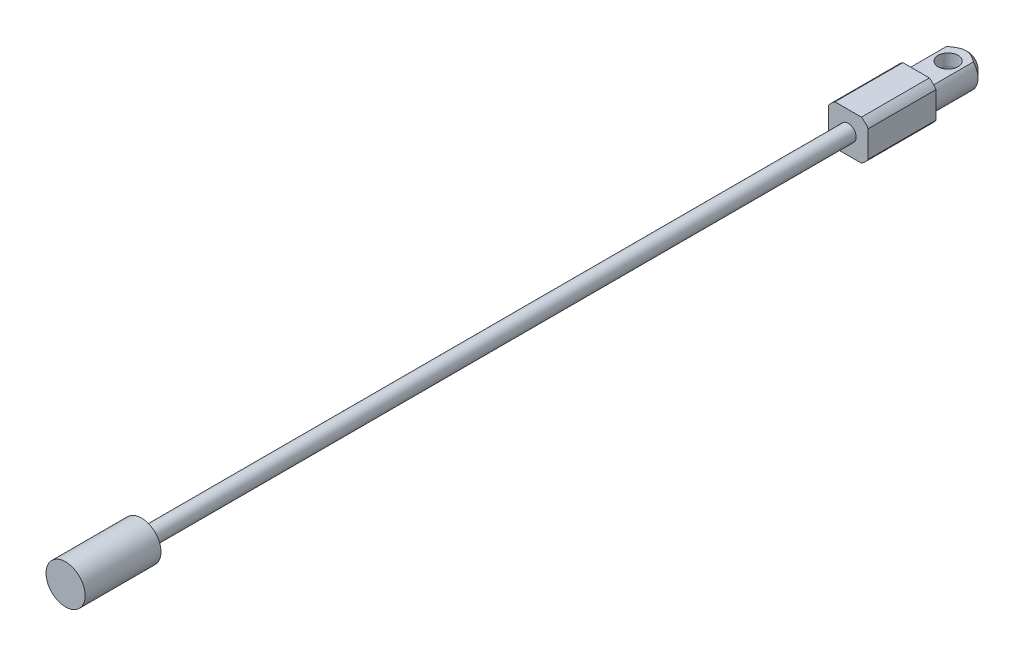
ISO-10303-21;
HEADER;
FILE_DESCRIPTION(('STEP AP214'),'2;1');
FILE_NAME('part.step','',(''),(''),'','','');
FILE_SCHEMA(('AUTOMOTIVE_DESIGN { 1 0 10303 214 1 1 1 1 }'));
ENDSEC;
DATA;
#1=APPLICATION_CONTEXT('core data for automotive mechanical design processes');
#2=APPLICATION_PROTOCOL_DEFINITION('international standard','automotive_design',2000,#1);
#3=PRODUCT_CONTEXT('',#1,'mechanical');
#4=PRODUCT('Part','Part','',(#3));
#5=PRODUCT_RELATED_PRODUCT_CATEGORY('part','',(#4));
#6=PRODUCT_DEFINITION_FORMATION('','',#4);
#7=PRODUCT_DEFINITION_CONTEXT('part definition',#1,'design');
#8=PRODUCT_DEFINITION('design','',#6,#7);
#9=PRODUCT_DEFINITION_SHAPE('','',#8);
#10=(LENGTH_UNIT() NAMED_UNIT(*) SI_UNIT(.MILLI.,.METRE.));
#11=(NAMED_UNIT(*) PLANE_ANGLE_UNIT() SI_UNIT($,.RADIAN.));
#12=(NAMED_UNIT(*) SI_UNIT($,.STERADIAN.) SOLID_ANGLE_UNIT());
#13=UNCERTAINTY_MEASURE_WITH_UNIT(LENGTH_MEASURE(1.E-05),#10,'distance_accuracy_value','');
#14=(GEOMETRIC_REPRESENTATION_CONTEXT(3) GLOBAL_UNCERTAINTY_ASSIGNED_CONTEXT((#13)) GLOBAL_UNIT_ASSIGNED_CONTEXT((#10,
#11,#12)) REPRESENTATION_CONTEXT('',''));
#15=CARTESIAN_POINT('',(0.,0.,0.));
#16=DIRECTION('',(0.,0.,1.));
#17=DIRECTION('',(1.,0.,0.));
#18=AXIS2_PLACEMENT_3D('',#15,#16,#17);
#19=CARTESIAN_POINT('',(0.,-6.35,6.35));
#20=DIRECTION('',(0.,1.,0.));
#21=DIRECTION('',(0.,0.,1.));
#22=AXIS2_PLACEMENT_3D('',#19,#20,#21);
#23=CYLINDRICAL_SURFACE('',#22,3.175);
#24=CARTESIAN_POINT('',(0.,3.81,6.35));
#25=DIRECTION('',(0.,1.,0.));
#26=DIRECTION('',(0.,0.,1.));
#27=AXIS2_PLACEMENT_3D('',#24,#25,#26);
#28=CIRCLE('',#27,3.175);
#29=CARTESIAN_POINT('',(0.,3.81,9.525));
#30=VERTEX_POINT('',#29);
#31=EDGE_CURVE('E254',#30,#30,#28,.T.);
#32=ORIENTED_EDGE('',*,*,#31,.T.);
#33=EDGE_LOOP('',(#32));
#34=FACE_BOUND('',#33,.T.);
#35=CARTESIAN_POINT('',(0.,0.,6.35));
#36=DIRECTION('',(0.,-1.,0.));
#37=DIRECTION('',(0.,0.,-1.));
#38=AXIS2_PLACEMENT_3D('',#35,#36,#37);
#39=CIRCLE('',#38,3.175);
#40=CARTESIAN_POINT('',(0.,0.,3.175));
#41=VERTEX_POINT('',#40);
#42=EDGE_CURVE('E11',#41,#41,#39,.F.);
#43=ORIENTED_EDGE('',*,*,#42,.F.);
#44=EDGE_LOOP('',(#43));
#45=FACE_BOUND('',#44,.T.);
#46=ADVANCED_FACE('F34',(#34,#45),#23,.F.);
#47=CARTESIAN_POINT('',(0.,0.,16.51));
#48=DIRECTION('',(0.,0.,-1.));
#49=DIRECTION('',(-1.,0.,0.));
#50=AXIS2_PLACEMENT_3D('',#47,#48,#49);
#51=CYLINDRICAL_SURFACE('',#50,5.715);
#52=CARTESIAN_POINT('',(0.,0.,16.51));
#53=DIRECTION('',(0.,0.,1.));
#54=DIRECTION('',(1.,0.,0.));
#55=AXIS2_PLACEMENT_3D('',#52,#53,#54);
#56=CIRCLE('',#55,5.715);
#57=CARTESIAN_POINT('',(4.2597094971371,-3.81,16.51));
#58=VERTEX_POINT('',#57);
#59=CARTESIAN_POINT('',(4.2597094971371,3.81,16.51));
#60=VERTEX_POINT('',#59);
#61=EDGE_CURVE('E137',#58,#60,#56,.T.);
#62=ORIENTED_EDGE('',*,*,#61,.F.);
#63=DIRECTION('',(0.,0.,-1.));
#64=VECTOR('',#63,1.);
#65=CARTESIAN_POINT('',(4.2597094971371,-3.81,16.51));
#66=LINE('',#65,#64);
#67=CARTESIAN_POINT('',(4.2597094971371,-3.81,2.54));
#68=VERTEX_POINT('',#67);
#69=EDGE_CURVE('E124',#58,#68,#66,.T.);
#70=ORIENTED_EDGE('',*,*,#69,.T.);
#71=CARTESIAN_POINT('',(0.,0.,2.54));
#72=DIRECTION('',(0.,0.,1.));
#73=DIRECTION('',(1.,0.,0.));
#74=AXIS2_PLACEMENT_3D('',#71,#72,#73);
#75=CIRCLE('',#74,5.715);
#76=CARTESIAN_POINT('',(4.2597094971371,3.81,2.54));
#77=VERTEX_POINT('',#76);
#78=EDGE_CURVE('E59',#68,#77,#75,.T.);
#79=ORIENTED_EDGE('',*,*,#78,.T.);
#80=DIRECTION('',(0.,0.,-1.));
#81=VECTOR('',#80,1.);
#82=CARTESIAN_POINT('',(4.2597094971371,3.81,16.51));
#83=LINE('',#82,#81);
#84=EDGE_CURVE('E144',#60,#77,#83,.T.);
#85=ORIENTED_EDGE('',*,*,#84,.F.);
#86=EDGE_LOOP('',(#62,#70,#79,#85));
#87=FACE_BOUND('',#86,.T.);
#88=ADVANCED_FACE('F143',(#87),#51,.T.);
#89=CARTESIAN_POINT('',(-4.2597094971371,3.81,2.54));
#90=VERTEX_POINT('',#89);
#91=CARTESIAN_POINT('',(-4.2597094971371,-3.81,2.54));
#92=VERTEX_POINT('',#91);
#93=EDGE_CURVE('E152',#90,#92,#75,.T.);
#94=ORIENTED_EDGE('',*,*,#93,.T.);
#95=DIRECTION('',(0.,0.,-1.));
#96=VECTOR('',#95,1.);
#97=CARTESIAN_POINT('',(-4.2597094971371,-3.81,16.51));
#98=LINE('',#97,#96);
#99=CARTESIAN_POINT('',(-4.2597094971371,-3.81,16.51));
#100=VERTEX_POINT('',#99);
#101=EDGE_CURVE('E51',#92,#100,#98,.F.);
#102=ORIENTED_EDGE('',*,*,#101,.T.);
#103=CARTESIAN_POINT('',(-4.2597094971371,3.81,16.51));
#104=VERTEX_POINT('',#103);
#105=EDGE_CURVE('E140',#104,#100,#56,.T.);
#106=ORIENTED_EDGE('',*,*,#105,.F.);
#107=DIRECTION('',(0.,0.,-1.));
#108=VECTOR('',#107,1.);
#109=CARTESIAN_POINT('',(-4.2597094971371,3.81,16.51));
#110=LINE('',#109,#108);
#111=EDGE_CURVE('E265',#90,#104,#110,.F.);
#112=ORIENTED_EDGE('',*,*,#111,.F.);
#113=EDGE_LOOP('',(#94,#102,#106,#112));
#114=FACE_BOUND('',#113,.T.);
#115=ADVANCED_FACE('F229',(#114),#51,.T.);
#116=CARTESIAN_POINT('',(0.,0.,2.54));
#117=DIRECTION('',(0.,0.,1.));
#118=DIRECTION('',(1.,0.,0.));
#119=AXIS2_PLACEMENT_3D('',#116,#117,#118);
#120=CONICAL_SURFACE('',#119,5.715,0.78539816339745);
#121=CARTESIAN_POINT('',(-8.20850946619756,-3.81,5.87462582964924));
#122=CARTESIAN_POINT('',(-8.02595740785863,-3.81,5.70906152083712));
#123=CARTESIAN_POINT('',(-7.84293576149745,-3.81,5.54401103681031));
#124=CARTESIAN_POINT('',(-7.47571023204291,-3.81,5.21520621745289));
#125=CARTESIAN_POINT('',(-7.29150627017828,-3.81,5.05145197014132));
#126=CARTESIAN_POINT('',(-6.9211860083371,-3.81,4.72507964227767));
#127=CARTESIAN_POINT('',(-6.7350658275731,-3.81,4.56246595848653));
#128=CARTESIAN_POINT('',(-6.36110548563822,-3.81,4.23923701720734));
#129=CARTESIAN_POINT('',(-6.17326537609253,-3.81,4.07862170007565));
#130=CARTESIAN_POINT('',(-5.78453216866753,-3.81,3.75070430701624));
#131=CARTESIAN_POINT('',(-5.58351215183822,-3.81,3.58355232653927));
#132=CARTESIAN_POINT('',(-5.17844491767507,-3.81,3.25296047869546));
#133=CARTESIAN_POINT('',(-4.9743978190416,-3.81,3.08952046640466));
#134=CARTESIAN_POINT('',(-4.56262054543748,-3.81,2.76781828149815));
#135=CARTESIAN_POINT('',(-4.35489483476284,-3.81,2.60955041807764));
#136=CARTESIAN_POINT('',(-3.93436432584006,-3.81,2.29994412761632));
#137=CARTESIAN_POINT('',(-3.72156062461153,-3.81,2.14860422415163));
#138=CARTESIAN_POINT('',(-3.32936172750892,-3.81,1.88306314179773));
#139=CARTESIAN_POINT('',(-3.15110760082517,-3.81,1.76718694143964));
#140=CARTESIAN_POINT('',(-2.78884457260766,-3.81,1.54446052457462));
#141=CARTESIAN_POINT('',(-2.60483262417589,-3.81,1.43761520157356));
#142=CARTESIAN_POINT('',(-2.23169635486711,-3.81,1.23770533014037));
#143=CARTESIAN_POINT('',(-2.04263972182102,-3.81,1.14451610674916));
#144=CARTESIAN_POINT('',(-1.65672613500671,-3.81,0.976003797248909));
#145=CARTESIAN_POINT('',(-1.45987898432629,-3.81,0.900659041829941));
#146=CARTESIAN_POINT('',(-1.14516442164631,-3.81,0.801908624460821));
#147=CARTESIAN_POINT('',(-1.02992599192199,-3.81,0.770128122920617));
#148=CARTESIAN_POINT('',(-0.797257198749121,-3.81,0.715878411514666));
#149=CARTESIAN_POINT('',(-0.679827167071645,-3.81,0.693407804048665));
#150=CARTESIAN_POINT('',(-0.44389239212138,-3.81,0.659003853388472));
#151=CARTESIAN_POINT('',(-0.325393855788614,-3.81,0.647028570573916));
#152=CARTESIAN_POINT('',(-0.0877886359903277,-3.81,0.634165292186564));
#153=CARTESIAN_POINT('',(0.0313180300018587,-3.81,0.63327697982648));
#154=CARTESIAN_POINT('',(0.269123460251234,-3.81,0.642643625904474));
#155=CARTESIAN_POINT('',(0.387822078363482,-3.81,0.652902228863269));
#156=CARTESIAN_POINT('',(0.623819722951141,-3.81,0.683957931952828));
#157=CARTESIAN_POINT('',(0.741118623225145,-3.81,0.704755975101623));
#158=CARTESIAN_POINT('',(0.974164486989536,-3.81,0.755915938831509));
#159=CARTESIAN_POINT('',(1.08990146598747,-3.81,0.786322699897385));
#160=CARTESIAN_POINT('',(1.31887476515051,-3.81,0.855335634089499));
#161=CARTESIAN_POINT('',(1.43211100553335,-3.81,0.893942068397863));
#162=CARTESIAN_POINT('',(1.67972031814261,-3.81,0.986939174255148));
#163=CARTESIAN_POINT('',(1.81348420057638,-3.81,1.04294095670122));
#164=CARTESIAN_POINT('',(2.07739860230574,-3.81,1.16295578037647));
#165=CARTESIAN_POINT('',(2.20754729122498,-3.81,1.22697279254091));
#166=CARTESIAN_POINT('',(2.46476599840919,-3.81,1.36142255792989));
#167=CARTESIAN_POINT('',(2.59182992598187,-3.81,1.43186687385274));
#168=CARTESIAN_POINT('',(2.8430242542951,-3.81,1.57772926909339));
#169=CARTESIAN_POINT('',(2.96715510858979,-3.81,1.65314657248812));
#170=CARTESIAN_POINT('',(3.21460772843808,-3.81,1.8090188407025));
#171=CARTESIAN_POINT('',(3.33789450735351,-3.81,1.88952908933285));
#172=CARTESIAN_POINT('',(3.58226641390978,-3.81,2.05381959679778));
#173=CARTESIAN_POINT('',(3.70335147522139,-3.81,2.1375999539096));
#174=CARTESIAN_POINT('',(3.94350183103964,-3.81,2.30771224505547));
#175=CARTESIAN_POINT('',(4.06256928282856,-3.81,2.3940411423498));
#176=CARTESIAN_POINT('',(4.29909363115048,-3.81,2.56886328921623));
#177=CARTESIAN_POINT('',(4.41655058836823,-3.81,2.65735645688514));
#178=CARTESIAN_POINT('',(4.67170796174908,-3.81,2.8526876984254));
#179=CARTESIAN_POINT('',(4.80913011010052,-3.81,2.95988882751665));
#180=CARTESIAN_POINT('',(5.08235453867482,-3.81,3.17633832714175));
#181=CARTESIAN_POINT('',(5.21815677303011,-3.81,3.28558675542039));
#182=CARTESIAN_POINT('',(5.62355343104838,-3.81,3.61585903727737));
#183=CARTESIAN_POINT('',(5.8911077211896,-3.81,3.8393865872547));
#184=CARTESIAN_POINT('',(6.42237477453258,-3.81,4.29116075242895));
#185=CARTESIAN_POINT('',(6.68608585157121,-3.81,4.51940933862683));
#186=CARTESIAN_POINT('',(7.21055437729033,-3.81,4.9792817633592));
#187=CARTESIAN_POINT('',(7.47131175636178,-3.81,5.21090568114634));
#188=CARTESIAN_POINT('',(7.9910976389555,-3.81,5.67714827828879));
#189=CARTESIAN_POINT('',(8.25012149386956,-3.81,5.91177212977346));
#190=CARTESIAN_POINT('',(8.76639653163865,-3.81,6.38296669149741));
#191=CARTESIAN_POINT('',(9.02364769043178,-3.81,6.61953742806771));
#192=CARTESIAN_POINT('',(9.79316982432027,-3.81,7.33137999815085));
#193=CARTESIAN_POINT('',(10.3033508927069,-3.81,7.80890997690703));
#194=CARTESIAN_POINT('',(11.2600778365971,-3.81,8.71127550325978));
#195=CARTESIAN_POINT('',(11.7070303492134,-3.81,9.13568139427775));
#196=CARTESIAN_POINT('',(12.5988941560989,-3.81,9.98670298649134));
#197=CARTESIAN_POINT('',(13.0438052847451,-3.81,10.4133188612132));
#198=CARTESIAN_POINT('',(13.9304986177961,-3.81,11.2666199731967));
#199=CARTESIAN_POINT('',(14.3722863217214,-3.81,11.6932995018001));
#200=CARTESIAN_POINT('',(15.2546290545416,-3.81,12.5478514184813));
#201=CARTESIAN_POINT('',(15.695184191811,-3.81,12.9757236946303));
#202=CARTESIAN_POINT('',(16.1353112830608,-3.81,13.4040340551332));
#203=B_SPLINE_CURVE_WITH_KNOTS('',3,(#121,#122,#123,#124,#125,#126,#127,#128,#129,#130,#131,
#132,#133,#134,#135,#136,#137,#138,#139,#140,#141,#142,#143,#144,#145,#146,#147,#148,#149,#150,
#151,#152,#153,#154,#155,#156,#157,#158,#159,#160,#161,#162,#163,#164,#165,#166,#167,#168,#169,
#170,#171,#172,#173,#174,#175,#176,#177,#178,#179,#180,#181,#182,#183,#184,#185,#186,#187,#188,
#189,#190,#191,#192,#193,#194,#195,#196,#197,#198,#199,#200,#201,#202),.UNSPECIFIED.,.F.,.F.,(4,
2,2,2,2,2,2,2,2,2,2,2,2,2,2,2,2,2,2,2,2,2,2,2,2,2,2,2,2,2,2,2,2,2,2,2,2,2,2,2,4),(0.,
0.739348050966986,1.47874588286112,2.22018935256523,2.96161063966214,3.74588607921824,
4.53013084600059,5.31348149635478,6.09666442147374,6.73429703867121,7.3722729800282,
8.00400304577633,8.63496199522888,8.9932647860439,9.35151376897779,9.70832456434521,
10.0651251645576,10.4220424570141,10.7789916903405,11.1376319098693,11.4962835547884,
11.9309814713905,12.3658956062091,12.8016081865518,13.2372529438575,13.6789282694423,
14.120616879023,14.5617988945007,15.0029642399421,15.5258086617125,16.0486678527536,
17.0945003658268,18.1407786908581,19.1870816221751,20.2355326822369,21.2839979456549,
23.3803566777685,25.2293984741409,27.0785877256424,28.9211612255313,30.7635672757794),.UNSPECIFIED.);
#204=EDGE_CURVE('E128',#92,#68,#203,.T.);
#205=ORIENTED_EDGE('',*,*,#204,.F.);
#206=ORIENTED_EDGE('',*,*,#93,.F.);
#207=CARTESIAN_POINT('',(-8.20850946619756,3.81,5.87462582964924));
#208=CARTESIAN_POINT('',(-8.02595740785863,3.81,5.70906152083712));
#209=CARTESIAN_POINT('',(-7.84293576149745,3.81,5.54401103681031));
#210=CARTESIAN_POINT('',(-7.47571023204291,3.81,5.21520621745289));
#211=CARTESIAN_POINT('',(-7.29150627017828,3.81,5.05145197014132));
#212=CARTESIAN_POINT('',(-6.9211860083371,3.81,4.72507964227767));
#213=CARTESIAN_POINT('',(-6.7350658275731,3.81,4.56246595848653));
#214=CARTESIAN_POINT('',(-6.36110548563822,3.81,4.23923701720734));
#215=CARTESIAN_POINT('',(-6.17326537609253,3.81,4.07862170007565));
#216=CARTESIAN_POINT('',(-5.78453216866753,3.81,3.75070430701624));
#217=CARTESIAN_POINT('',(-5.58351215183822,3.81,3.58355232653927));
#218=CARTESIAN_POINT('',(-5.17844491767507,3.81,3.25296047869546));
#219=CARTESIAN_POINT('',(-4.9743978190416,3.81,3.08952046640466));
#220=CARTESIAN_POINT('',(-4.56262054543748,3.81,2.76781828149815));
#221=CARTESIAN_POINT('',(-4.35489483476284,3.81,2.60955041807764));
#222=CARTESIAN_POINT('',(-3.93436432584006,3.81,2.29994412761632));
#223=CARTESIAN_POINT('',(-3.72156062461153,3.81,2.14860422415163));
#224=CARTESIAN_POINT('',(-3.32936172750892,3.81,1.88306314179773));
#225=CARTESIAN_POINT('',(-3.15110760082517,3.81,1.76718694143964));
#226=CARTESIAN_POINT('',(-2.78884457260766,3.81,1.54446052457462));
#227=CARTESIAN_POINT('',(-2.60483262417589,3.81,1.43761520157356));
#228=CARTESIAN_POINT('',(-2.23169635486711,3.81,1.23770533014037));
#229=CARTESIAN_POINT('',(-2.04263972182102,3.81,1.14451610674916));
#230=CARTESIAN_POINT('',(-1.65672613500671,3.81,0.976003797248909));
#231=CARTESIAN_POINT('',(-1.45987898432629,3.81,0.900659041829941));
#232=CARTESIAN_POINT('',(-1.14516442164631,3.81,0.801908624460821));
#233=CARTESIAN_POINT('',(-1.02992599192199,3.81,0.770128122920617));
#234=CARTESIAN_POINT('',(-0.797257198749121,3.81,0.715878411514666));
#235=CARTESIAN_POINT('',(-0.679827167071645,3.81,0.693407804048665));
#236=CARTESIAN_POINT('',(-0.44389239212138,3.81,0.659003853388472));
#237=CARTESIAN_POINT('',(-0.325393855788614,3.81,0.647028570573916));
#238=CARTESIAN_POINT('',(-0.0877886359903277,3.81,0.634165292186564));
#239=CARTESIAN_POINT('',(0.0313180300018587,3.81,0.63327697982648));
#240=CARTESIAN_POINT('',(0.269123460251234,3.81,0.642643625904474));
#241=CARTESIAN_POINT('',(0.387822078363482,3.81,0.652902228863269));
#242=CARTESIAN_POINT('',(0.623819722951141,3.81,0.683957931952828));
#243=CARTESIAN_POINT('',(0.741118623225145,3.81,0.704755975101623));
#244=CARTESIAN_POINT('',(0.974164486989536,3.81,0.755915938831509));
#245=CARTESIAN_POINT('',(1.08990146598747,3.81,0.786322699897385));
#246=CARTESIAN_POINT('',(1.31887476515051,3.81,0.855335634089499));
#247=CARTESIAN_POINT('',(1.43211100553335,3.81,0.893942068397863));
#248=CARTESIAN_POINT('',(1.67972031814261,3.81,0.986939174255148));
#249=CARTESIAN_POINT('',(1.81348420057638,3.81,1.04294095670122));
#250=CARTESIAN_POINT('',(2.07739860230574,3.81,1.16295578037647));
#251=CARTESIAN_POINT('',(2.20754729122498,3.81,1.22697279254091));
#252=CARTESIAN_POINT('',(2.46476599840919,3.81,1.36142255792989));
#253=CARTESIAN_POINT('',(2.59182992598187,3.81,1.43186687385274));
#254=CARTESIAN_POINT('',(2.8430242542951,3.81,1.57772926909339));
#255=CARTESIAN_POINT('',(2.96715510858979,3.81,1.65314657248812));
#256=CARTESIAN_POINT('',(3.21460772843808,3.81,1.8090188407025));
#257=CARTESIAN_POINT('',(3.33789450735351,3.81,1.88952908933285));
#258=CARTESIAN_POINT('',(3.58226641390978,3.81,2.05381959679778));
#259=CARTESIAN_POINT('',(3.70335147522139,3.81,2.1375999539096));
#260=CARTESIAN_POINT('',(3.94350183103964,3.81,2.30771224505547));
#261=CARTESIAN_POINT('',(4.06256928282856,3.81,2.3940411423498));
#262=CARTESIAN_POINT('',(4.29909363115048,3.81,2.56886328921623));
#263=CARTESIAN_POINT('',(4.41655058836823,3.81,2.65735645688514));
#264=CARTESIAN_POINT('',(4.67170796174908,3.81,2.8526876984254));
#265=CARTESIAN_POINT('',(4.80913011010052,3.81,2.95988882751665));
#266=CARTESIAN_POINT('',(5.08235453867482,3.81,3.17633832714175));
#267=CARTESIAN_POINT('',(5.21815677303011,3.81,3.28558675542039));
#268=CARTESIAN_POINT('',(5.62355343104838,3.81,3.61585903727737));
#269=CARTESIAN_POINT('',(5.8911077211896,3.81,3.8393865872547));
#270=CARTESIAN_POINT('',(6.42237477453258,3.81,4.29116075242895));
#271=CARTESIAN_POINT('',(6.68608585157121,3.81,4.51940933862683));
#272=CARTESIAN_POINT('',(7.21055437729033,3.81,4.9792817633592));
#273=CARTESIAN_POINT('',(7.47131175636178,3.81,5.21090568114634));
#274=CARTESIAN_POINT('',(7.9910976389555,3.81,5.67714827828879));
#275=CARTESIAN_POINT('',(8.25012149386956,3.81,5.91177212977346));
#276=CARTESIAN_POINT('',(8.76639653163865,3.81,6.38296669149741));
#277=CARTESIAN_POINT('',(9.02364769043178,3.81,6.61953742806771));
#278=CARTESIAN_POINT('',(9.79316982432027,3.81,7.33137999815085));
#279=CARTESIAN_POINT('',(10.3033508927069,3.81,7.80890997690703));
#280=CARTESIAN_POINT('',(11.2600778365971,3.81,8.71127550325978));
#281=CARTESIAN_POINT('',(11.7070303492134,3.81,9.13568139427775));
#282=CARTESIAN_POINT('',(12.5988941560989,3.81,9.98670298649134));
#283=CARTESIAN_POINT('',(13.0438052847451,3.81,10.4133188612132));
#284=CARTESIAN_POINT('',(13.9304986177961,3.81,11.2666199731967));
#285=CARTESIAN_POINT('',(14.3722863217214,3.81,11.6932995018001));
#286=CARTESIAN_POINT('',(15.2546290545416,3.81,12.5478514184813));
#287=CARTESIAN_POINT('',(15.695184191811,3.81,12.9757236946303));
#288=CARTESIAN_POINT('',(16.1353112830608,3.81,13.4040340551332));
#289=B_SPLINE_CURVE_WITH_KNOTS('',3,(#207,#208,#209,#210,#211,#212,#213,#214,#215,#216,#217,
#218,#219,#220,#221,#222,#223,#224,#225,#226,#227,#228,#229,#230,#231,#232,#233,#234,#235,#236,
#237,#238,#239,#240,#241,#242,#243,#244,#245,#246,#247,#248,#249,#250,#251,#252,#253,#254,#255,
#256,#257,#258,#259,#260,#261,#262,#263,#264,#265,#266,#267,#268,#269,#270,#271,#272,#273,#274,
#275,#276,#277,#278,#279,#280,#281,#282,#283,#284,#285,#286,#287,#288),.UNSPECIFIED.,.F.,.F.,(4,
2,2,2,2,2,2,2,2,2,2,2,2,2,2,2,2,2,2,2,2,2,2,2,2,2,2,2,2,2,2,2,2,2,2,2,2,2,2,2,4),(0.,
0.739348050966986,1.47874588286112,2.22018935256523,2.96161063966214,3.74588607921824,
4.53013084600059,5.31348149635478,6.09666442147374,6.73429703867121,7.3722729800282,
8.00400304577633,8.63496199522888,8.9932647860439,9.35151376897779,9.70832456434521,
10.0651251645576,10.4220424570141,10.7789916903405,11.1376319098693,11.4962835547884,
11.9309814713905,12.3658956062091,12.8016081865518,13.2372529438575,13.6789282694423,
14.120616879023,14.5617988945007,15.0029642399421,15.5258086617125,16.0486678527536,
17.0945003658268,18.1407786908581,19.1870816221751,20.2355326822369,21.2839979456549,
23.3803566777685,25.2293984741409,27.0785877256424,28.9211612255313,30.7635672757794),.UNSPECIFIED.);
#290=EDGE_CURVE('E44',#90,#77,#289,.T.);
#291=ORIENTED_EDGE('',*,*,#290,.T.);
#292=ORIENTED_EDGE('',*,*,#78,.F.);
#293=EDGE_LOOP('',(#205,#206,#291,#292));
#294=FACE_BOUND('',#293,.T.);
#295=CARTESIAN_POINT('',(0.,0.,0.));
#296=DIRECTION('',(0.,0.,1.));
#297=DIRECTION('',(1.,0.,0.));
#298=AXIS2_PLACEMENT_3D('',#295,#296,#297);
#299=CIRCLE('',#298,3.17499999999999);
#300=CARTESIAN_POINT('',(3.17499999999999,0.,0.));
#301=VERTEX_POINT('',#300);
#302=EDGE_CURVE('E155',#301,#301,#299,.F.);
#303=ORIENTED_EDGE('',*,*,#302,.F.);
#304=EDGE_LOOP('',(#303));
#305=FACE_BOUND('',#304,.T.);
#306=ADVANCED_FACE('F36',(#294,#305),#120,.T.);
#307=CARTESIAN_POINT('',(0.,0.,38.1));
#308=DIRECTION('',(0.,0.,1.));
#309=DIRECTION('',(1.,0.,0.));
#310=AXIS2_PLACEMENT_3D('',#307,#308,#309);
#311=PLANE('',#310);
#312=CARTESIAN_POINT('',(0.,0.,38.1));
#313=DIRECTION('',(0.,0.,1.));
#314=DIRECTION('',(1.,0.,0.));
#315=AXIS2_PLACEMENT_3D('',#312,#313,#314);
#316=CIRCLE('',#315,7.62);
#317=CARTESIAN_POINT('',(4.21211348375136,-6.35,38.1));
#318=VERTEX_POINT('',#317);
#319=CARTESIAN_POINT('',(6.35,-4.21211348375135,38.1));
#320=VERTEX_POINT('',#319);
#321=EDGE_CURVE('E281',#318,#320,#316,.T.);
#322=ORIENTED_EDGE('',*,*,#321,.T.);
#323=DIRECTION('',(0.,1.,0.));
#324=VECTOR('',#323,1.);
#325=CARTESIAN_POINT('',(6.35,4.21211348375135,38.1));
#326=LINE('',#325,#324);
#327=CARTESIAN_POINT('',(6.35,4.21211348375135,38.1));
#328=VERTEX_POINT('',#327);
#329=EDGE_CURVE('E284',#320,#328,#326,.T.);
#330=ORIENTED_EDGE('',*,*,#329,.T.);
#331=CARTESIAN_POINT('',(0.,0.,38.1));
#332=DIRECTION('',(0.,0.,1.));
#333=DIRECTION('',(1.,0.,0.));
#334=AXIS2_PLACEMENT_3D('',#331,#332,#333);
#335=CIRCLE('',#334,7.62);
#336=CARTESIAN_POINT('',(4.21211348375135,6.35,38.1));
#337=VERTEX_POINT('',#336);
#338=EDGE_CURVE('E287',#328,#337,#335,.T.);
#339=ORIENTED_EDGE('',*,*,#338,.T.);
#340=DIRECTION('',(-1.,0.,0.));
#341=VECTOR('',#340,1.);
#342=CARTESIAN_POINT('',(-4.21211348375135,6.35,38.1));
#343=LINE('',#342,#341);
#344=CARTESIAN_POINT('',(-4.21211348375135,6.35,38.1));
#345=VERTEX_POINT('',#344);
#346=EDGE_CURVE('E289',#337,#345,#343,.T.);
#347=ORIENTED_EDGE('',*,*,#346,.T.);
#348=CARTESIAN_POINT('',(0.,0.,38.1));
#349=DIRECTION('',(0.,0.,1.));
#350=DIRECTION('',(1.,0.,0.));
#351=AXIS2_PLACEMENT_3D('',#348,#349,#350);
#352=CIRCLE('',#351,7.62);
#353=CARTESIAN_POINT('',(-6.35,4.21211348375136,38.1));
#354=VERTEX_POINT('',#353);
#355=EDGE_CURVE('E291',#345,#354,#352,.T.);
#356=ORIENTED_EDGE('',*,*,#355,.T.);
#357=DIRECTION('',(0.,-1.,0.));
#358=VECTOR('',#357,1.);
#359=CARTESIAN_POINT('',(-6.35,4.21211348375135,38.1));
#360=LINE('',#359,#358);
#361=CARTESIAN_POINT('',(-6.35,-4.21211348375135,38.1));
#362=VERTEX_POINT('',#361);
#363=EDGE_CURVE('E293',#354,#362,#360,.T.);
#364=ORIENTED_EDGE('',*,*,#363,.T.);
#365=CARTESIAN_POINT('',(0.,0.,38.1));
#366=DIRECTION('',(0.,0.,1.));
#367=DIRECTION('',(1.,0.,0.));
#368=AXIS2_PLACEMENT_3D('',#365,#366,#367);
#369=CIRCLE('',#368,7.62);
#370=CARTESIAN_POINT('',(-4.21211348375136,-6.35,38.1));
#371=VERTEX_POINT('',#370);
#372=EDGE_CURVE('E295',#362,#371,#369,.T.);
#373=ORIENTED_EDGE('',*,*,#372,.T.);
#374=DIRECTION('',(1.,0.,0.));
#375=VECTOR('',#374,1.);
#376=CARTESIAN_POINT('',(-4.21211348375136,-6.35,38.1));
#377=LINE('',#376,#375);
#378=EDGE_CURVE('E297',#371,#318,#377,.T.);
#379=ORIENTED_EDGE('',*,*,#378,.T.);
#380=EDGE_LOOP('',(#322,#330,#339,#347,#356,#364,#373,#379));
#381=FACE_BOUND('',#380,.T.);
#382=CARTESIAN_POINT('',(0.,0.,38.1));
#383=DIRECTION('',(0.,0.,1.));
#384=DIRECTION('',(1.,0.,0.));
#385=AXIS2_PLACEMENT_3D('',#382,#383,#384);
#386=CIRCLE('',#385,2.54);
#387=CARTESIAN_POINT('',(-2.54,0.,38.1));
#388=VERTEX_POINT('',#387);
#389=EDGE_CURVE('E272',#388,#388,#386,.T.);
#390=ORIENTED_EDGE('',*,*,#389,.F.);
#391=EDGE_LOOP('',(#390));
#392=FACE_BOUND('',#391,.T.);
#393=ADVANCED_FACE('F189',(#381,#392),#311,.T.);
#394=CARTESIAN_POINT('',(0.,0.,0.));
#395=DIRECTION('',(0.,0.,1.));
#396=DIRECTION('',(1.,0.,0.));
#397=AXIS2_PLACEMENT_3D('',#394,#395,#396);
#398=PLANE('',#397);
#399=ORIENTED_EDGE('',*,*,#302,.T.);
#400=EDGE_LOOP('',(#399));
#401=FACE_BOUND('',#400,.T.);
#402=ADVANCED_FACE('F192',(#401),#398,.F.);
#403=CARTESIAN_POINT('',(0.,0.,16.51));
#404=DIRECTION('',(0.,0.,1.));
#405=DIRECTION('',(1.,0.,0.));
#406=AXIS2_PLACEMENT_3D('',#403,#404,#405);
#407=PLANE('',#406);
#408=ORIENTED_EDGE('',*,*,#105,.T.);
#409=DIRECTION('',(-1.,0.,0.));
#410=VECTOR('',#409,1.);
#411=CARTESIAN_POINT('',(6.35,-3.81,16.51));
#412=LINE('',#411,#410);
#413=EDGE_CURVE('E127',#58,#100,#412,.T.);
#414=ORIENTED_EDGE('',*,*,#413,.F.);
#415=ORIENTED_EDGE('',*,*,#61,.T.);
#416=DIRECTION('',(-1.,0.,0.));
#417=VECTOR('',#416,1.);
#418=CARTESIAN_POINT('',(6.35,3.81,16.51));
#419=LINE('',#418,#417);
#420=EDGE_CURVE('E130',#60,#104,#419,.T.);
#421=ORIENTED_EDGE('',*,*,#420,.T.);
#422=EDGE_LOOP('',(#408,#414,#415,#421));
#423=FACE_BOUND('',#422,.T.);
#424=CARTESIAN_POINT('',(0.,0.,16.51));
#425=DIRECTION('',(0.,0.,1.));
#426=DIRECTION('',(1.,0.,0.));
#427=AXIS2_PLACEMENT_3D('',#424,#425,#426);
#428=CIRCLE('',#427,7.62);
#429=CARTESIAN_POINT('',(6.35,4.21211348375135,16.51));
#430=VERTEX_POINT('',#429);
#431=CARTESIAN_POINT('',(4.21211348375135,6.35,16.51));
#432=VERTEX_POINT('',#431);
#433=EDGE_CURVE('E304',#430,#432,#428,.T.);
#434=ORIENTED_EDGE('',*,*,#433,.F.);
#435=DIRECTION('',(0.,1.,0.));
#436=VECTOR('',#435,1.);
#437=CARTESIAN_POINT('',(6.35,4.21211348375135,16.51));
#438=LINE('',#437,#436);
#439=CARTESIAN_POINT('',(6.35,-4.21211348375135,16.51));
#440=VERTEX_POINT('',#439);
#441=EDGE_CURVE('E302',#440,#430,#438,.T.);
#442=ORIENTED_EDGE('',*,*,#441,.F.);
#443=CARTESIAN_POINT('',(0.,0.,16.51));
#444=DIRECTION('',(0.,0.,1.));
#445=DIRECTION('',(1.,0.,0.));
#446=AXIS2_PLACEMENT_3D('',#443,#444,#445);
#447=CIRCLE('',#446,7.62);
#448=CARTESIAN_POINT('',(4.21211348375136,-6.35,16.51));
#449=VERTEX_POINT('',#448);
#450=EDGE_CURVE('E278',#449,#440,#447,.T.);
#451=ORIENTED_EDGE('',*,*,#450,.F.);
#452=DIRECTION('',(1.,0.,0.));
#453=VECTOR('',#452,1.);
#454=CARTESIAN_POINT('',(-4.21211348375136,-6.35,16.51));
#455=LINE('',#454,#453);
#456=CARTESIAN_POINT('',(-4.21211348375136,-6.35,16.51));
#457=VERTEX_POINT('',#456);
#458=EDGE_CURVE('E285',#457,#449,#455,.T.);
#459=ORIENTED_EDGE('',*,*,#458,.F.);
#460=CARTESIAN_POINT('',(0.,0.,16.51));
#461=DIRECTION('',(0.,0.,1.));
#462=DIRECTION('',(1.,0.,0.));
#463=AXIS2_PLACEMENT_3D('',#460,#461,#462);
#464=CIRCLE('',#463,7.62);
#465=CARTESIAN_POINT('',(-6.35,-4.21211348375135,16.51));
#466=VERTEX_POINT('',#465);
#467=EDGE_CURVE('E312',#466,#457,#464,.T.);
#468=ORIENTED_EDGE('',*,*,#467,.F.);
#469=DIRECTION('',(0.,-1.,0.));
#470=VECTOR('',#469,1.);
#471=CARTESIAN_POINT('',(-6.35,4.21211348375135,16.51));
#472=LINE('',#471,#470);
#473=CARTESIAN_POINT('',(-6.35,4.21211348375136,16.51));
#474=VERTEX_POINT('',#473);
#475=EDGE_CURVE('E310',#474,#466,#472,.T.);
#476=ORIENTED_EDGE('',*,*,#475,.F.);
#477=CARTESIAN_POINT('',(0.,0.,16.51));
#478=DIRECTION('',(0.,0.,1.));
#479=DIRECTION('',(1.,0.,0.));
#480=AXIS2_PLACEMENT_3D('',#477,#478,#479);
#481=CIRCLE('',#480,7.62);
#482=CARTESIAN_POINT('',(-4.21211348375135,6.35,16.51));
#483=VERTEX_POINT('',#482);
#484=EDGE_CURVE('E308',#483,#474,#481,.T.);
#485=ORIENTED_EDGE('',*,*,#484,.F.);
#486=DIRECTION('',(-1.,0.,0.));
#487=VECTOR('',#486,1.);
#488=CARTESIAN_POINT('',(-4.21211348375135,6.35,16.51));
#489=LINE('',#488,#487);
#490=EDGE_CURVE('E306',#432,#483,#489,.T.);
#491=ORIENTED_EDGE('',*,*,#490,.F.);
#492=EDGE_LOOP('',(#434,#442,#451,#459,#468,#476,#485,#491));
#493=FACE_BOUND('',#492,.T.);
#494=ADVANCED_FACE('F134',(#423,#493),#407,.F.);
#495=CARTESIAN_POINT('',(0.,0.,38.1));
#496=DIRECTION('',(0.,0.,-1.));
#497=DIRECTION('',(-1.,0.,0.));
#498=AXIS2_PLACEMENT_3D('',#495,#496,#497);
#499=CYLINDRICAL_SURFACE('',#498,7.62);
#500=ORIENTED_EDGE('',*,*,#450,.T.);
#501=DIRECTION('',(0.,0.,-1.));
#502=VECTOR('',#501,1.);
#503=CARTESIAN_POINT('',(6.35,-4.21211348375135,38.1));
#504=LINE('',#503,#502);
#505=EDGE_CURVE('E145',#320,#440,#504,.T.);
#506=ORIENTED_EDGE('',*,*,#505,.F.);
#507=ORIENTED_EDGE('',*,*,#321,.F.);
#508=DIRECTION('',(0.,0.,-1.));
#509=VECTOR('',#508,1.);
#510=CARTESIAN_POINT('',(4.21211348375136,-6.35,38.1));
#511=LINE('',#510,#509);
#512=EDGE_CURVE('E299',#318,#449,#511,.T.);
#513=ORIENTED_EDGE('',*,*,#512,.T.);
#514=EDGE_LOOP('',(#500,#506,#507,#513));
#515=FACE_BOUND('',#514,.T.);
#516=ADVANCED_FACE('F196',(#515),#499,.T.);
#517=CARTESIAN_POINT('',(6.35,4.21211348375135,38.1));
#518=DIRECTION('',(-1.,0.,0.));
#519=DIRECTION('',(0.,-1.,0.));
#520=AXIS2_PLACEMENT_3D('',#517,#518,#519);
#521=PLANE('',#520);
#522=ORIENTED_EDGE('',*,*,#441,.T.);
#523=DIRECTION('',(0.,0.,-1.));
#524=VECTOR('',#523,1.);
#525=CARTESIAN_POINT('',(6.35,4.21211348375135,38.1));
#526=LINE('',#525,#524);
#527=EDGE_CURVE('E148',#328,#430,#526,.T.);
#528=ORIENTED_EDGE('',*,*,#527,.F.);
#529=ORIENTED_EDGE('',*,*,#329,.F.);
#530=ORIENTED_EDGE('',*,*,#505,.T.);
#531=EDGE_LOOP('',(#522,#528,#529,#530));
#532=FACE_BOUND('',#531,.T.);
#533=ADVANCED_FACE('F219',(#532),#521,.F.);
#534=CARTESIAN_POINT('',(0.,0.,38.1));
#535=DIRECTION('',(0.,0.,-1.));
#536=DIRECTION('',(-1.,0.,0.));
#537=AXIS2_PLACEMENT_3D('',#534,#535,#536);
#538=CYLINDRICAL_SURFACE('',#537,7.62);
#539=ORIENTED_EDGE('',*,*,#433,.T.);
#540=DIRECTION('',(0.,0.,-1.));
#541=VECTOR('',#540,1.);
#542=CARTESIAN_POINT('',(4.21211348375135,6.35,38.1));
#543=LINE('',#542,#541);
#544=EDGE_CURVE('E329',#337,#432,#543,.T.);
#545=ORIENTED_EDGE('',*,*,#544,.F.);
#546=ORIENTED_EDGE('',*,*,#338,.F.);
#547=ORIENTED_EDGE('',*,*,#527,.T.);
#548=EDGE_LOOP('',(#539,#545,#546,#547));
#549=FACE_BOUND('',#548,.T.);
#550=ADVANCED_FACE('F215',(#549),#538,.T.);
#551=CARTESIAN_POINT('',(-4.21211348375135,6.35,38.1));
#552=DIRECTION('',(0.,-1.,0.));
#553=DIRECTION('',(0.,0.,-1.));
#554=AXIS2_PLACEMENT_3D('',#551,#552,#553);
#555=PLANE('',#554);
#556=ORIENTED_EDGE('',*,*,#490,.T.);
#557=DIRECTION('',(0.,0.,-1.));
#558=VECTOR('',#557,1.);
#559=CARTESIAN_POINT('',(-4.21211348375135,6.35,38.1));
#560=LINE('',#559,#558);
#561=EDGE_CURVE('E326',#345,#483,#560,.T.);
#562=ORIENTED_EDGE('',*,*,#561,.F.);
#563=ORIENTED_EDGE('',*,*,#346,.F.);
#564=ORIENTED_EDGE('',*,*,#544,.T.);
#565=EDGE_LOOP('',(#556,#562,#563,#564));
#566=FACE_BOUND('',#565,.T.);
#567=ADVANCED_FACE('F211',(#566),#555,.F.);
#568=CARTESIAN_POINT('',(0.,0.,38.1));
#569=DIRECTION('',(0.,0.,-1.));
#570=DIRECTION('',(-1.,0.,0.));
#571=AXIS2_PLACEMENT_3D('',#568,#569,#570);
#572=CYLINDRICAL_SURFACE('',#571,7.62);
#573=ORIENTED_EDGE('',*,*,#484,.T.);
#574=DIRECTION('',(0.,0.,-1.));
#575=VECTOR('',#574,1.);
#576=CARTESIAN_POINT('',(-6.35,4.21211348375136,38.1));
#577=LINE('',#576,#575);
#578=EDGE_CURVE('E323',#354,#474,#577,.T.);
#579=ORIENTED_EDGE('',*,*,#578,.F.);
#580=ORIENTED_EDGE('',*,*,#355,.F.);
#581=ORIENTED_EDGE('',*,*,#561,.T.);
#582=EDGE_LOOP('',(#573,#579,#580,#581));
#583=FACE_BOUND('',#582,.T.);
#584=ADVANCED_FACE('F207',(#583),#572,.T.);
#585=CARTESIAN_POINT('',(-6.35,4.21211348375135,38.1));
#586=DIRECTION('',(1.,0.,0.));
#587=DIRECTION('',(0.,0.,-1.));
#588=AXIS2_PLACEMENT_3D('',#585,#586,#587);
#589=PLANE('',#588);
#590=ORIENTED_EDGE('',*,*,#475,.T.);
#591=DIRECTION('',(0.,0.,-1.));
#592=VECTOR('',#591,1.);
#593=CARTESIAN_POINT('',(-6.35,-4.21211348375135,38.1));
#594=LINE('',#593,#592);
#595=EDGE_CURVE('E320',#362,#466,#594,.T.);
#596=ORIENTED_EDGE('',*,*,#595,.F.);
#597=ORIENTED_EDGE('',*,*,#363,.F.);
#598=ORIENTED_EDGE('',*,*,#578,.T.);
#599=EDGE_LOOP('',(#590,#596,#597,#598));
#600=FACE_BOUND('',#599,.T.);
#601=ADVANCED_FACE('F203',(#600),#589,.F.);
#602=CARTESIAN_POINT('',(0.,0.,38.1));
#603=DIRECTION('',(0.,0.,-1.));
#604=DIRECTION('',(-1.,0.,0.));
#605=AXIS2_PLACEMENT_3D('',#602,#603,#604);
#606=CYLINDRICAL_SURFACE('',#605,7.62);
#607=ORIENTED_EDGE('',*,*,#467,.T.);
#608=DIRECTION('',(0.,0.,-1.));
#609=VECTOR('',#608,1.);
#610=CARTESIAN_POINT('',(-4.21211348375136,-6.35,38.1));
#611=LINE('',#610,#609);
#612=EDGE_CURVE('E317',#371,#457,#611,.T.);
#613=ORIENTED_EDGE('',*,*,#612,.F.);
#614=ORIENTED_EDGE('',*,*,#372,.F.);
#615=ORIENTED_EDGE('',*,*,#595,.T.);
#616=EDGE_LOOP('',(#607,#613,#614,#615));
#617=FACE_BOUND('',#616,.T.);
#618=ADVANCED_FACE('F199',(#617),#606,.T.);
#619=CARTESIAN_POINT('',(-4.21211348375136,-6.35,38.1));
#620=DIRECTION('',(0.,1.,0.));
#621=DIRECTION('',(-1.,0.,0.));
#622=AXIS2_PLACEMENT_3D('',#619,#620,#621);
#623=PLANE('',#622);
#624=ORIENTED_EDGE('',*,*,#458,.T.);
#625=ORIENTED_EDGE('',*,*,#512,.F.);
#626=ORIENTED_EDGE('',*,*,#378,.F.);
#627=ORIENTED_EDGE('',*,*,#612,.T.);
#628=EDGE_LOOP('',(#624,#625,#626,#627));
#629=FACE_BOUND('',#628,.T.);
#630=ADVANCED_FACE('F187',(#629),#623,.F.);
#631=CARTESIAN_POINT('',(0.,0.,262.89));
#632=DIRECTION('',(0.,0.,-1.));
#633=DIRECTION('',(-1.,0.,0.));
#634=AXIS2_PLACEMENT_3D('',#631,#632,#633);
#635=CYLINDRICAL_SURFACE('',#634,2.54);
#636=CARTESIAN_POINT('',(0.,0.,262.89));
#637=DIRECTION('',(0.,0.,1.));
#638=DIRECTION('',(1.,0.,0.));
#639=AXIS2_PLACEMENT_3D('',#636,#637,#638);
#640=CIRCLE('',#639,2.54);
#641=CARTESIAN_POINT('',(-2.54,0.,262.89));
#642=VERTEX_POINT('',#641);
#643=EDGE_CURVE('E275',#642,#642,#640,.T.);
#644=CARTESIAN_POINT('',(-2.54,0.,262.89));
#645=CARTESIAN_POINT('',(-2.54,0.,260.5484375));
#646=CARTESIAN_POINT('',(-2.54,0.,258.206875));
#647=CARTESIAN_POINT('',(-2.54,0.,253.52375));
#648=CARTESIAN_POINT('',(-2.54,0.,251.1821875));
#649=CARTESIAN_POINT('',(-2.54,0.,246.4990625));
#650=CARTESIAN_POINT('',(-2.54,0.,244.1575));
#651=CARTESIAN_POINT('',(-2.54,0.,239.474375));
#652=CARTESIAN_POINT('',(-2.54,0.,237.1328125));
#653=CARTESIAN_POINT('',(-2.54,0.,232.4496875));
#654=CARTESIAN_POINT('',(-2.54,0.,230.108125));
#655=CARTESIAN_POINT('',(-2.54,0.,225.425));
#656=CARTESIAN_POINT('',(-2.54,0.,223.0834375));
#657=CARTESIAN_POINT('',(-2.54,0.,218.4003125));
#658=CARTESIAN_POINT('',(-2.54,0.,216.05875));
#659=CARTESIAN_POINT('',(-2.54,0.,211.375625));
#660=CARTESIAN_POINT('',(-2.54,0.,209.0340625));
#661=CARTESIAN_POINT('',(-2.54,0.,204.3509375));
#662=CARTESIAN_POINT('',(-2.54,0.,202.009375));
#663=CARTESIAN_POINT('',(-2.54,0.,197.32625));
#664=CARTESIAN_POINT('',(-2.54,0.,194.9846875));
#665=CARTESIAN_POINT('',(-2.54,0.,190.3015625));
#666=CARTESIAN_POINT('',(-2.54,0.,187.96));
#667=CARTESIAN_POINT('',(-2.54,0.,183.276875));
#668=CARTESIAN_POINT('',(-2.54,0.,180.9353125));
#669=CARTESIAN_POINT('',(-2.54,0.,176.2521875));
#670=CARTESIAN_POINT('',(-2.54,0.,173.910625));
#671=CARTESIAN_POINT('',(-2.54,0.,169.2275));
#672=CARTESIAN_POINT('',(-2.54,0.,166.8859375));
#673=CARTESIAN_POINT('',(-2.54,0.,162.2028125));
#674=CARTESIAN_POINT('',(-2.54,0.,159.86125));
#675=CARTESIAN_POINT('',(-2.54,0.,155.178125));
#676=CARTESIAN_POINT('',(-2.54,0.,152.8365625));
#677=CARTESIAN_POINT('',(-2.54,0.,148.1534375));
#678=CARTESIAN_POINT('',(-2.54,0.,145.811875));
#679=CARTESIAN_POINT('',(-2.54,0.,141.12875));
#680=CARTESIAN_POINT('',(-2.54,0.,138.7871875));
#681=CARTESIAN_POINT('',(-2.54,0.,134.1040625));
#682=CARTESIAN_POINT('',(-2.54,0.,131.7625));
#683=CARTESIAN_POINT('',(-2.54,0.,127.079375));
#684=CARTESIAN_POINT('',(-2.54,0.,124.7378125));
#685=CARTESIAN_POINT('',(-2.54,0.,120.0546875));
#686=CARTESIAN_POINT('',(-2.54,0.,117.713125));
#687=CARTESIAN_POINT('',(-2.54,0.,113.03));
#688=CARTESIAN_POINT('',(-2.54,0.,110.6884375));
#689=CARTESIAN_POINT('',(-2.54,0.,106.0053125));
#690=CARTESIAN_POINT('',(-2.54,0.,103.66375));
#691=CARTESIAN_POINT('',(-2.54,0.,98.980625));
#692=CARTESIAN_POINT('',(-2.54,0.,96.6390625));
#693=CARTESIAN_POINT('',(-2.54,0.,91.9559375));
#694=CARTESIAN_POINT('',(-2.54,0.,89.614375));
#695=CARTESIAN_POINT('',(-2.54,0.,84.93125));
#696=CARTESIAN_POINT('',(-2.54,0.,82.5896875));
#697=CARTESIAN_POINT('',(-2.54,0.,77.9065625));
#698=CARTESIAN_POINT('',(-2.54,0.,75.565));
#699=CARTESIAN_POINT('',(-2.54,0.,70.881875));
#700=CARTESIAN_POINT('',(-2.54,0.,68.5403125));
#701=CARTESIAN_POINT('',(-2.54,0.,63.8571875));
#702=CARTESIAN_POINT('',(-2.54,0.,61.515625));
#703=CARTESIAN_POINT('',(-2.54,0.,56.8325));
#704=CARTESIAN_POINT('',(-2.54,0.,54.4909375));
#705=CARTESIAN_POINT('',(-2.54,0.,49.8078125));
#706=CARTESIAN_POINT('',(-2.54,0.,47.46625));
#707=CARTESIAN_POINT('',(-2.54,0.,42.783125));
#708=CARTESIAN_POINT('',(-2.54,0.,40.4415625));
#709=CARTESIAN_POINT('',(-2.54,0.,38.1));
#710=B_SPLINE_CURVE_WITH_KNOTS('',3,(#644,#645,#646,#647,#648,#649,#650,#651,#652,#653,#654,
#655,#656,#657,#658,#659,#660,#661,#662,#663,#664,#665,#666,#667,#668,#669,#670,#671,#672,#673,
#674,#675,#676,#677,#678,#679,#680,#681,#682,#683,#684,#685,#686,#687,#688,#689,#690,#691,#692,
#693,#694,#695,#696,#697,#698,#699,#700,#701,#702,#703,#704,#705,#706,#707,#708,#709),
.UNSPECIFIED.,.F.,.F.,(4,2,2,2,2,2,2,2,2,2,2,2,2,2,2,2,2,2,2,2,2,2,2,2,2,2,2,2,2,2,2,2,4),(0.,
7.02468749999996,14.049375,21.0740625,28.0987499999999,35.1234375,42.148125,49.1728124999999,
56.1975,63.2221874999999,70.2468749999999,77.2715624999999,84.29625,91.3209374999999,
98.3456249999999,105.3703125,112.395,119.4196875,126.444375,133.4690625,140.49375,147.5184375,
154.543125,161.5678125,168.5925,175.6171875,182.641875,189.6665625,196.69125,203.7159375,
210.740625,217.7653125,224.79),.UNSPECIFIED.);
#711=EDGE_CURVE('BSEAM180',#642,#388,#710,.T.);
#712=ORIENTED_EDGE('',*,*,#643,.F.);
#713=ORIENTED_EDGE('',*,*,#389,.T.);
#714=ORIENTED_EDGE('',*,*,#711,.T.);
#715=ORIENTED_EDGE('',*,*,#711,.F.);
#716=EDGE_LOOP('',(#712,#714,#713,#715));
#717=FACE_BOUND('',#716,.T.);
#718=ADVANCED_FACE('F180',(#717),#635,.T.);
#719=CARTESIAN_POINT('',(0.,0.,262.89));
#720=DIRECTION('',(0.,0.,1.));
#721=DIRECTION('',(1.,0.,0.));
#722=AXIS2_PLACEMENT_3D('',#719,#720,#721);
#723=PLANE('',#722);
#724=CARTESIAN_POINT('',(0.,0.,262.89));
#725=DIRECTION('',(0.,0.,1.));
#726=DIRECTION('',(1.,0.,0.));
#727=AXIS2_PLACEMENT_3D('',#724,#725,#726);
#728=CIRCLE('',#727,6.223);
#729=CARTESIAN_POINT('',(-6.223,0.,262.89));
#730=VERTEX_POINT('',#729);
#731=EDGE_CURVE('E268',#730,#730,#728,.T.);
#732=ORIENTED_EDGE('',*,*,#731,.F.);
#733=EDGE_LOOP('',(#732));
#734=FACE_BOUND('',#733,.T.);
#735=ORIENTED_EDGE('',*,*,#643,.T.);
#736=EDGE_LOOP('',(#735));
#737=FACE_BOUND('',#736,.T.);
#738=ADVANCED_FACE('F177',(#734,#737),#723,.F.);
#739=CARTESIAN_POINT('',(0.,0.,287.02));
#740=DIRECTION('',(0.,0.,-1.));
#741=DIRECTION('',(-1.,0.,0.));
#742=AXIS2_PLACEMENT_3D('',#739,#740,#741);
#743=CYLINDRICAL_SURFACE('',#742,6.223);
#744=CARTESIAN_POINT('',(0.,0.,287.02));
#745=DIRECTION('',(0.,0.,1.));
#746=DIRECTION('',(1.,0.,0.));
#747=AXIS2_PLACEMENT_3D('',#744,#745,#746);
#748=CIRCLE('',#747,6.223);
#749=CARTESIAN_POINT('',(-6.223,0.,287.02));
#750=VERTEX_POINT('',#749);
#751=EDGE_CURVE('E269',#750,#750,#748,.T.);
#752=CARTESIAN_POINT('',(-6.223,0.,287.02));
#753=CARTESIAN_POINT('',(-6.223,0.,286.768645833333));
#754=CARTESIAN_POINT('',(-6.223,0.,286.517291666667));
#755=CARTESIAN_POINT('',(-6.223,0.,286.014583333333));
#756=CARTESIAN_POINT('',(-6.223,0.,285.763229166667));
#757=CARTESIAN_POINT('',(-6.223,0.,285.260520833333));
#758=CARTESIAN_POINT('',(-6.223,0.,285.009166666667));
#759=CARTESIAN_POINT('',(-6.223,0.,284.506458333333));
#760=CARTESIAN_POINT('',(-6.223,0.,284.255104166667));
#761=CARTESIAN_POINT('',(-6.223,0.,283.752395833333));
#762=CARTESIAN_POINT('',(-6.223,0.,283.501041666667));
#763=CARTESIAN_POINT('',(-6.223,0.,282.998333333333));
#764=CARTESIAN_POINT('',(-6.223,0.,282.746979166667));
#765=CARTESIAN_POINT('',(-6.223,0.,282.244270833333));
#766=CARTESIAN_POINT('',(-6.223,0.,281.992916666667));
#767=CARTESIAN_POINT('',(-6.223,0.,281.490208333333));
#768=CARTESIAN_POINT('',(-6.223,0.,281.238854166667));
#769=CARTESIAN_POINT('',(-6.223,0.,280.736145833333));
#770=CARTESIAN_POINT('',(-6.223,0.,280.484791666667));
#771=CARTESIAN_POINT('',(-6.223,0.,279.982083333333));
#772=CARTESIAN_POINT('',(-6.223,0.,279.730729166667));
#773=CARTESIAN_POINT('',(-6.223,0.,279.228020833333));
#774=CARTESIAN_POINT('',(-6.223,0.,278.976666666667));
#775=CARTESIAN_POINT('',(-6.223,0.,278.473958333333));
#776=CARTESIAN_POINT('',(-6.223,0.,278.222604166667));
#777=CARTESIAN_POINT('',(-6.223,0.,277.719895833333));
#778=CARTESIAN_POINT('',(-6.223,0.,277.468541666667));
#779=CARTESIAN_POINT('',(-6.223,0.,276.965833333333));
#780=CARTESIAN_POINT('',(-6.223,0.,276.714479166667));
#781=CARTESIAN_POINT('',(-6.223,0.,276.211770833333));
#782=CARTESIAN_POINT('',(-6.223,0.,275.960416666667));
#783=CARTESIAN_POINT('',(-6.223,0.,275.457708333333));
#784=CARTESIAN_POINT('',(-6.223,0.,275.206354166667));
#785=CARTESIAN_POINT('',(-6.223,0.,274.703645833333));
#786=CARTESIAN_POINT('',(-6.223,0.,274.452291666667));
#787=CARTESIAN_POINT('',(-6.223,0.,273.949583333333));
#788=CARTESIAN_POINT('',(-6.223,0.,273.698229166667));
#789=CARTESIAN_POINT('',(-6.223,0.,273.195520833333));
#790=CARTESIAN_POINT('',(-6.223,0.,272.944166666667));
#791=CARTESIAN_POINT('',(-6.223,0.,272.441458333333));
#792=CARTESIAN_POINT('',(-6.223,0.,272.190104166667));
#793=CARTESIAN_POINT('',(-6.223,0.,271.687395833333));
#794=CARTESIAN_POINT('',(-6.223,0.,271.436041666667));
#795=CARTESIAN_POINT('',(-6.223,0.,270.933333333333));
#796=CARTESIAN_POINT('',(-6.223,0.,270.681979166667));
#797=CARTESIAN_POINT('',(-6.223,0.,270.179270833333));
#798=CARTESIAN_POINT('',(-6.223,0.,269.927916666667));
#799=CARTESIAN_POINT('',(-6.223,0.,269.425208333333));
#800=CARTESIAN_POINT('',(-6.223,0.,269.173854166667));
#801=CARTESIAN_POINT('',(-6.223,0.,268.671145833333));
#802=CARTESIAN_POINT('',(-6.223,0.,268.419791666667));
#803=CARTESIAN_POINT('',(-6.223,0.,267.917083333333));
#804=CARTESIAN_POINT('',(-6.223,0.,267.665729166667));
#805=CARTESIAN_POINT('',(-6.223,0.,267.163020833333));
#806=CARTESIAN_POINT('',(-6.223,0.,266.911666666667));
#807=CARTESIAN_POINT('',(-6.223,0.,266.408958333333));
#808=CARTESIAN_POINT('',(-6.223,0.,266.157604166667));
#809=CARTESIAN_POINT('',(-6.223,0.,265.654895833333));
#810=CARTESIAN_POINT('',(-6.223,0.,265.403541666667));
#811=CARTESIAN_POINT('',(-6.223,0.,264.900833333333));
#812=CARTESIAN_POINT('',(-6.223,0.,264.649479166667));
#813=CARTESIAN_POINT('',(-6.223,0.,264.146770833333));
#814=CARTESIAN_POINT('',(-6.223,0.,263.895416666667));
#815=CARTESIAN_POINT('',(-6.223,0.,263.392708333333));
#816=CARTESIAN_POINT('',(-6.223,0.,263.141354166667));
#817=CARTESIAN_POINT('',(-6.223,0.,262.89));
#818=B_SPLINE_CURVE_WITH_KNOTS('',3,(#752,#753,#754,#755,#756,#757,#758,#759,#760,#761,#762,
#763,#764,#765,#766,#767,#768,#769,#770,#771,#772,#773,#774,#775,#776,#777,#778,#779,#780,#781,
#782,#783,#784,#785,#786,#787,#788,#789,#790,#791,#792,#793,#794,#795,#796,#797,#798,#799,#800,
#801,#802,#803,#804,#805,#806,#807,#808,#809,#810,#811,#812,#813,#814,#815,#816,#817),
.UNSPECIFIED.,.F.,.F.,(4,2,2,2,2,2,2,2,2,2,2,2,2,2,2,2,2,2,2,2,2,2,2,2,2,2,2,2,2,2,2,2,4),(0.,
0.754062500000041,1.50812500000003,2.26218750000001,3.01625000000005,3.77031250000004,
4.52437500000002,5.27843750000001,6.03250000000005,6.78656250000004,7.54062500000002,
8.29468750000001,9.04875000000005,9.80281250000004,10.556875,11.3109375,12.065,12.8190625,
13.573125,14.3271875,15.08125,15.8353125,16.589375,17.3434375,18.0975,18.8515625,19.605625,
20.3596875,21.11375,21.8678125,22.621875,23.3759375,24.13),.UNSPECIFIED.);
#819=EDGE_CURVE('BSEAM175',#750,#730,#818,.T.);
#820=ORIENTED_EDGE('',*,*,#751,.F.);
#821=ORIENTED_EDGE('',*,*,#731,.T.);
#822=ORIENTED_EDGE('',*,*,#819,.T.);
#823=ORIENTED_EDGE('',*,*,#819,.F.);
#824=EDGE_LOOP('',(#820,#822,#821,#823));
#825=FACE_BOUND('',#824,.T.);
#826=ADVANCED_FACE('F175',(#825),#743,.T.);
#827=CARTESIAN_POINT('',(0.,0.,287.02));
#828=DIRECTION('',(0.,0.,1.));
#829=DIRECTION('',(1.,0.,0.));
#830=AXIS2_PLACEMENT_3D('',#827,#828,#829);
#831=PLANE('',#830);
#832=ORIENTED_EDGE('',*,*,#751,.T.);
#833=EDGE_LOOP('',(#832));
#834=FACE_BOUND('',#833,.T.);
#835=ADVANCED_FACE('F169',(#834),#831,.T.);
#836=CARTESIAN_POINT('',(6.35,3.81,16.51));
#837=DIRECTION('',(0.,1.,0.));
#838=DIRECTION('',(0.,0.,1.));
#839=AXIS2_PLACEMENT_3D('',#836,#837,#838);
#840=PLANE('',#839);
#841=ORIENTED_EDGE('',*,*,#31,.F.);
#842=EDGE_LOOP('',(#841));
#843=FACE_BOUND('',#842,.T.);
#844=ORIENTED_EDGE('',*,*,#84,.T.);
#845=ORIENTED_EDGE('',*,*,#290,.F.);
#846=ORIENTED_EDGE('',*,*,#111,.T.);
#847=ORIENTED_EDGE('',*,*,#420,.F.);
#848=EDGE_LOOP('',(#844,#845,#846,#847));
#849=FACE_BOUND('',#848,.T.);
#850=ADVANCED_FACE('F164',(#843,#849),#840,.T.);
#851=CARTESIAN_POINT('',(6.35,-3.81,16.51));
#852=DIRECTION('',(0.,1.,0.));
#853=DIRECTION('',(0.,0.,1.));
#854=AXIS2_PLACEMENT_3D('',#851,#852,#853);
#855=PLANE('',#854);
#856=CARTESIAN_POINT('',(0.,-3.81,6.35));
#857=DIRECTION('',(0.,1.,0.));
#858=DIRECTION('',(0.,0.,1.));
#859=AXIS2_PLACEMENT_3D('',#856,#857,#858);
#860=CIRCLE('',#859,3.175);
#861=CARTESIAN_POINT('',(0.,-3.81,9.525));
#862=VERTEX_POINT('',#861);
#863=EDGE_CURVE('E141',#862,#862,#860,.T.);
#864=ORIENTED_EDGE('',*,*,#863,.T.);
#865=EDGE_LOOP('',(#864));
#866=FACE_BOUND('',#865,.T.);
#867=ORIENTED_EDGE('',*,*,#413,.T.);
#868=ORIENTED_EDGE('',*,*,#101,.F.);
#869=ORIENTED_EDGE('',*,*,#204,.T.);
#870=ORIENTED_EDGE('',*,*,#69,.F.);
#871=EDGE_LOOP('',(#867,#868,#869,#870));
#872=FACE_BOUND('',#871,.T.);
#873=ADVANCED_FACE('F126',(#866,#872),#855,.F.);
#874=ORIENTED_EDGE('',*,*,#42,.T.);
#875=EDGE_LOOP('',(#874));
#876=FACE_BOUND('',#875,.T.);
#877=ORIENTED_EDGE('',*,*,#863,.F.);
#878=EDGE_LOOP('',(#877));
#879=FACE_BOUND('',#878,.T.);
#880=ADVANCED_FACE('F239',(#876,#879),#23,.F.);
#881=CLOSED_SHELL('',(#46,#88,#115,#306,#393,#402,#494,#516,#533,#550,#567,#584,#601,#618,#630,
#718,#738,#826,#835,#850,#873,#880));
#882=MANIFOLD_SOLID_BREP('B2',#881);
#883=ADVANCED_BREP_SHAPE_REPRESENTATION('',(#18,#882),#14);
#884=SHAPE_DEFINITION_REPRESENTATION(#9,#883);
ENDSEC;
END-ISO-10303-21;
